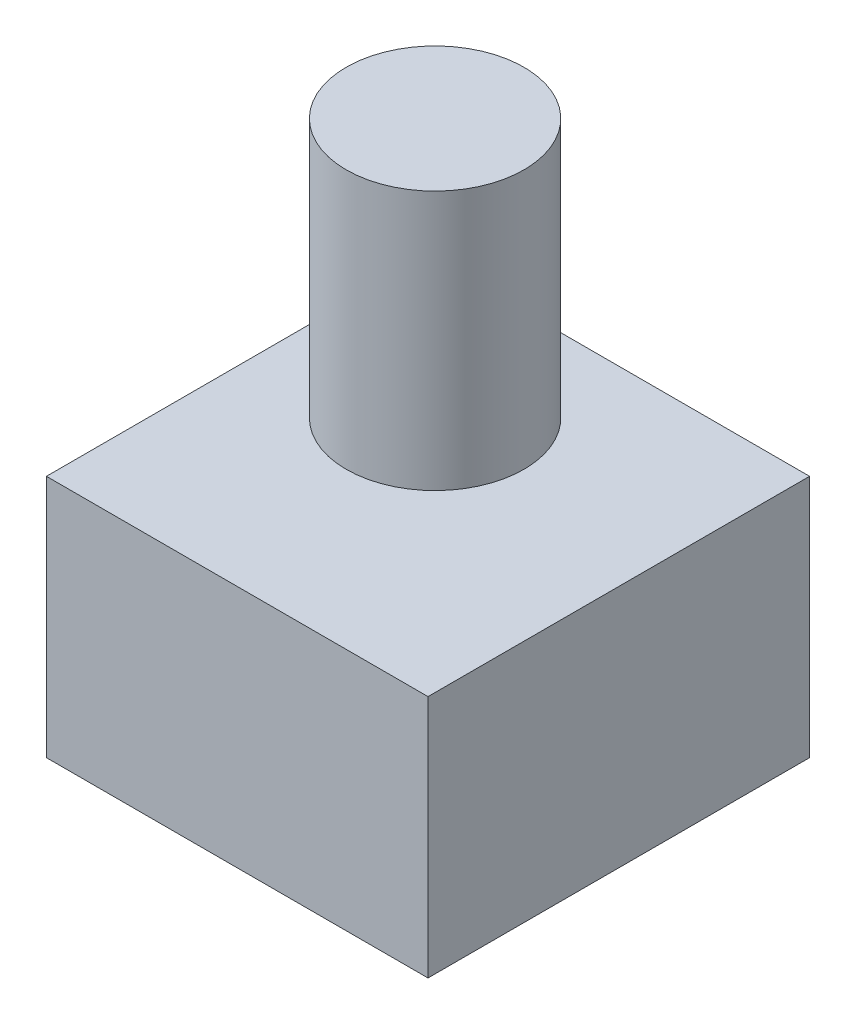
ISO-10303-21;
HEADER;
FILE_DESCRIPTION(('STEP AP214'),'2;1');
FILE_NAME('part.step','',(''),(''),'','','');
FILE_SCHEMA(('AUTOMOTIVE_DESIGN { 1 0 10303 214 1 1 1 1 }'));
ENDSEC;
DATA;
#1=APPLICATION_CONTEXT('core data for automotive mechanical design processes');
#2=APPLICATION_PROTOCOL_DEFINITION('international standard','automotive_design',2000,#1);
#3=PRODUCT_CONTEXT('',#1,'mechanical');
#4=PRODUCT('Part','Part','',(#3));
#5=PRODUCT_RELATED_PRODUCT_CATEGORY('part','',(#4));
#6=PRODUCT_DEFINITION_FORMATION('','',#4);
#7=PRODUCT_DEFINITION_CONTEXT('part definition',#1,'design');
#8=PRODUCT_DEFINITION('design','',#6,#7);
#9=PRODUCT_DEFINITION_SHAPE('','',#8);
#10=(LENGTH_UNIT() NAMED_UNIT(*) SI_UNIT(.MILLI.,.METRE.));
#11=(NAMED_UNIT(*) PLANE_ANGLE_UNIT() SI_UNIT($,.RADIAN.));
#12=(NAMED_UNIT(*) SI_UNIT($,.STERADIAN.) SOLID_ANGLE_UNIT());
#13=UNCERTAINTY_MEASURE_WITH_UNIT(LENGTH_MEASURE(1.E-05),#10,'distance_accuracy_value','');
#14=(GEOMETRIC_REPRESENTATION_CONTEXT(3) GLOBAL_UNCERTAINTY_ASSIGNED_CONTEXT((#13)) GLOBAL_UNIT_ASSIGNED_CONTEXT((#10,
#11,#12)) REPRESENTATION_CONTEXT('',''));
#15=CARTESIAN_POINT('',(0.,0.,0.));
#16=DIRECTION('',(0.,0.,1.));
#17=DIRECTION('',(1.,0.,0.));
#18=AXIS2_PLACEMENT_3D('',#15,#16,#17);
#19=CARTESIAN_POINT('',(-48.7636206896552,62.2905206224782,48.7636206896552));
#20=DIRECTION('',(0.,1.,0.));
#21=DIRECTION('',(0.,0.,1.));
#22=AXIS2_PLACEMENT_3D('',#19,#20,#21);
#23=PLANE('',#22);
#24=DIRECTION('',(0.,0.,1.));
#25=VECTOR('',#24,1.);
#26=CARTESIAN_POINT('',(-48.7636206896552,62.2905206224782,-48.7636206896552));
#27=LINE('',#26,#25);
#28=CARTESIAN_POINT('',(-48.7636206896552,62.2905206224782,-48.7636206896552));
#29=VERTEX_POINT('',#28);
#30=CARTESIAN_POINT('',(-48.7636206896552,62.2905206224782,48.7636206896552));
#31=VERTEX_POINT('',#30);
#32=EDGE_CURVE('E94',#29,#31,#27,.T.);
#33=ORIENTED_EDGE('',*,*,#32,.T.);
#34=DIRECTION('',(1.,0.,0.));
#35=VECTOR('',#34,1.);
#36=CARTESIAN_POINT('',(-48.7636206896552,62.2905206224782,48.7636206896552));
#37=LINE('',#36,#35);
#38=CARTESIAN_POINT('',(48.7636206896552,62.2905206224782,48.7636206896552));
#39=VERTEX_POINT('',#38);
#40=EDGE_CURVE('E79',#31,#39,#37,.T.);
#41=ORIENTED_EDGE('',*,*,#40,.T.);
#42=DIRECTION('',(0.,0.,-1.));
#43=VECTOR('',#42,1.);
#44=CARTESIAN_POINT('',(48.7636206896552,62.2905206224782,-48.7636206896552));
#45=LINE('',#44,#43);
#46=CARTESIAN_POINT('',(48.7636206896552,62.2905206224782,-48.7636206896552));
#47=VERTEX_POINT('',#46);
#48=EDGE_CURVE('E46',#39,#47,#45,.T.);
#49=ORIENTED_EDGE('',*,*,#48,.T.);
#50=DIRECTION('',(-1.,0.,0.));
#51=VECTOR('',#50,1.);
#52=CARTESIAN_POINT('',(-48.7636206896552,62.2905206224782,-48.7636206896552));
#53=LINE('',#52,#51);
#54=EDGE_CURVE('E41',#47,#29,#53,.T.);
#55=ORIENTED_EDGE('',*,*,#54,.T.);
#56=EDGE_LOOP('',(#33,#41,#49,#55));
#57=FACE_BOUND('',#56,.T.);
#58=CARTESIAN_POINT('',(-11.9920395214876,62.2905206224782,-13.8051445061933));
#59=DIRECTION('',(0.,1.,0.));
#60=DIRECTION('',(0.,0.,1.));
#61=AXIS2_PLACEMENT_3D('',#58,#59,#60);
#62=CIRCLE('',#61,22.7234164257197);
#63=CARTESIAN_POINT('',(-11.9920395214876,62.2905206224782,8.91827191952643));
#64=VERTEX_POINT('',#63);
#65=EDGE_CURVE('E87',#64,#64,#62,.T.);
#66=ORIENTED_EDGE('',*,*,#65,.F.);
#67=EDGE_LOOP('',(#66));
#68=FACE_BOUND('',#67,.T.);
#69=ADVANCED_FACE('F26',(#57,#68),#23,.T.);
#70=CARTESIAN_POINT('',(-48.7636206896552,62.2905206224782,-48.7636206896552));
#71=DIRECTION('',(1.,0.,0.));
#72=DIRECTION('',(0.,0.,-1.));
#73=AXIS2_PLACEMENT_3D('',#70,#71,#72);
#74=PLANE('',#73);
#75=DIRECTION('',(0.,0.,1.));
#76=VECTOR('',#75,1.);
#77=CARTESIAN_POINT('',(-48.7636206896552,0.,-48.7636206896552));
#78=LINE('',#77,#76);
#79=CARTESIAN_POINT('',(-48.7636206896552,0.,-48.7636206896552));
#80=VERTEX_POINT('',#79);
#81=CARTESIAN_POINT('',(-48.7636206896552,0.,48.7636206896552));
#82=VERTEX_POINT('',#81);
#83=EDGE_CURVE('E71',#80,#82,#78,.T.);
#84=ORIENTED_EDGE('',*,*,#83,.T.);
#85=DIRECTION('',(0.,-1.,0.));
#86=VECTOR('',#85,1.);
#87=CARTESIAN_POINT('',(-48.7636206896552,62.2905206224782,48.7636206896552));
#88=LINE('',#87,#86);
#89=EDGE_CURVE('E11',#31,#82,#88,.T.);
#90=ORIENTED_EDGE('',*,*,#89,.F.);
#91=ORIENTED_EDGE('',*,*,#32,.F.);
#92=DIRECTION('',(0.,-1.,0.));
#93=VECTOR('',#92,1.);
#94=CARTESIAN_POINT('',(-48.7636206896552,62.2905206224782,-48.7636206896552));
#95=LINE('',#94,#93);
#96=EDGE_CURVE('E83',#29,#80,#95,.T.);
#97=ORIENTED_EDGE('',*,*,#96,.T.);
#98=EDGE_LOOP('',(#84,#90,#91,#97));
#99=FACE_BOUND('',#98,.T.);
#100=ADVANCED_FACE('F28',(#99),#74,.F.);
#101=CARTESIAN_POINT('',(-48.7636206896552,62.2905206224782,48.7636206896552));
#102=DIRECTION('',(0.,0.,-1.));
#103=DIRECTION('',(-1.,0.,0.));
#104=AXIS2_PLACEMENT_3D('',#101,#102,#103);
#105=PLANE('',#104);
#106=DIRECTION('',(1.,0.,0.));
#107=VECTOR('',#106,1.);
#108=CARTESIAN_POINT('',(-48.7636206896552,0.,48.7636206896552));
#109=LINE('',#108,#107);
#110=CARTESIAN_POINT('',(48.7636206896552,0.,48.7636206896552));
#111=VERTEX_POINT('',#110);
#112=EDGE_CURVE('E67',#82,#111,#109,.T.);
#113=ORIENTED_EDGE('',*,*,#112,.T.);
#114=DIRECTION('',(0.,-1.,0.));
#115=VECTOR('',#114,1.);
#116=CARTESIAN_POINT('',(48.7636206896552,62.2905206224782,48.7636206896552));
#117=LINE('',#116,#115);
#118=EDGE_CURVE('E34',#39,#111,#117,.T.);
#119=ORIENTED_EDGE('',*,*,#118,.F.);
#120=ORIENTED_EDGE('',*,*,#40,.F.);
#121=ORIENTED_EDGE('',*,*,#89,.T.);
#122=EDGE_LOOP('',(#113,#119,#120,#121));
#123=FACE_BOUND('',#122,.T.);
#124=ADVANCED_FACE('F78',(#123),#105,.F.);
#125=CARTESIAN_POINT('',(48.7636206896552,62.2905206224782,-48.7636206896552));
#126=DIRECTION('',(-1.,0.,0.));
#127=DIRECTION('',(0.,0.,1.));
#128=AXIS2_PLACEMENT_3D('',#125,#126,#127);
#129=PLANE('',#128);
#130=DIRECTION('',(0.,0.,-1.));
#131=VECTOR('',#130,1.);
#132=CARTESIAN_POINT('',(48.7636206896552,0.,-48.7636206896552));
#133=LINE('',#132,#131);
#134=CARTESIAN_POINT('',(48.7636206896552,0.,-48.7636206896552));
#135=VERTEX_POINT('',#134);
#136=EDGE_CURVE('E72',#111,#135,#133,.T.);
#137=ORIENTED_EDGE('',*,*,#136,.T.);
#138=DIRECTION('',(0.,-1.,0.));
#139=VECTOR('',#138,1.);
#140=CARTESIAN_POINT('',(48.7636206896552,62.2905206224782,-48.7636206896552));
#141=LINE('',#140,#139);
#142=EDGE_CURVE('E100',#47,#135,#141,.T.);
#143=ORIENTED_EDGE('',*,*,#142,.F.);
#144=ORIENTED_EDGE('',*,*,#48,.F.);
#145=ORIENTED_EDGE('',*,*,#118,.T.);
#146=EDGE_LOOP('',(#137,#143,#144,#145));
#147=FACE_BOUND('',#146,.T.);
#148=ADVANCED_FACE('F103',(#147),#129,.F.);
#149=CARTESIAN_POINT('',(-48.7636206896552,62.2905206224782,-48.7636206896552));
#150=DIRECTION('',(0.,0.,1.));
#151=DIRECTION('',(1.,0.,0.));
#152=AXIS2_PLACEMENT_3D('',#149,#150,#151);
#153=PLANE('',#152);
#154=DIRECTION('',(-1.,0.,0.));
#155=VECTOR('',#154,1.);
#156=CARTESIAN_POINT('',(-48.7636206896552,0.,-48.7636206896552));
#157=LINE('',#156,#155);
#158=EDGE_CURVE('E92',#135,#80,#157,.T.);
#159=ORIENTED_EDGE('',*,*,#158,.T.);
#160=ORIENTED_EDGE('',*,*,#96,.F.);
#161=ORIENTED_EDGE('',*,*,#54,.F.);
#162=ORIENTED_EDGE('',*,*,#142,.T.);
#163=EDGE_LOOP('',(#159,#160,#161,#162));
#164=FACE_BOUND('',#163,.T.);
#165=ADVANCED_FACE('F105',(#164),#153,.F.);
#166=CARTESIAN_POINT('',(-48.7636206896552,0.,48.7636206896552));
#167=DIRECTION('',(0.,1.,0.));
#168=DIRECTION('',(0.,0.,1.));
#169=AXIS2_PLACEMENT_3D('',#166,#167,#168);
#170=PLANE('',#169);
#171=ORIENTED_EDGE('',*,*,#83,.F.);
#172=ORIENTED_EDGE('',*,*,#158,.F.);
#173=ORIENTED_EDGE('',*,*,#136,.F.);
#174=ORIENTED_EDGE('',*,*,#112,.F.);
#175=EDGE_LOOP('',(#171,#172,#173,#174));
#176=FACE_BOUND('',#175,.T.);
#177=ADVANCED_FACE('F68',(#176),#170,.F.);
#178=CARTESIAN_POINT('',(-11.9920395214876,128.586993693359,-13.8051445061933));
#179=DIRECTION('',(0.,-1.,0.));
#180=DIRECTION('',(0.,0.,-1.));
#181=AXIS2_PLACEMENT_3D('',#178,#179,#180);
#182=CYLINDRICAL_SURFACE('',#181,22.7234164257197);
#183=CARTESIAN_POINT('',(-11.9920395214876,128.586993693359,-13.8051445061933));
#184=DIRECTION('',(0.,1.,0.));
#185=DIRECTION('',(0.,0.,1.));
#186=AXIS2_PLACEMENT_3D('',#183,#184,#185);
#187=CIRCLE('',#186,22.7234164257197);
#188=CARTESIAN_POINT('',(-11.9920395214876,128.586993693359,8.91827191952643));
#189=VERTEX_POINT('',#188);
#190=EDGE_CURVE('E84',#189,#189,#187,.T.);
#191=ORIENTED_EDGE('',*,*,#190,.F.);
#192=EDGE_LOOP('',(#191));
#193=FACE_BOUND('',#192,.T.);
#194=ORIENTED_EDGE('',*,*,#65,.T.);
#195=EDGE_LOOP('',(#194));
#196=FACE_BOUND('',#195,.T.);
#197=ADVANCED_FACE('F112',(#193,#196),#182,.T.);
#198=CARTESIAN_POINT('',(-11.9920395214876,128.586993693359,-13.8051445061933));
#199=DIRECTION('',(0.,1.,0.));
#200=DIRECTION('',(0.,0.,1.));
#201=AXIS2_PLACEMENT_3D('',#198,#199,#200);
#202=PLANE('',#201);
#203=ORIENTED_EDGE('',*,*,#190,.T.);
#204=EDGE_LOOP('',(#203));
#205=FACE_BOUND('',#204,.T.);
#206=ADVANCED_FACE('F114',(#205),#202,.T.);
#207=CLOSED_SHELL('',(#69,#100,#124,#148,#165,#177,#197,#206));
#208=MANIFOLD_SOLID_BREP('B2',#207);
#209=ADVANCED_BREP_SHAPE_REPRESENTATION('',(#18,#208),#14);
#210=SHAPE_DEFINITION_REPRESENTATION(#9,#209);
ENDSEC;
END-ISO-10303-21;
